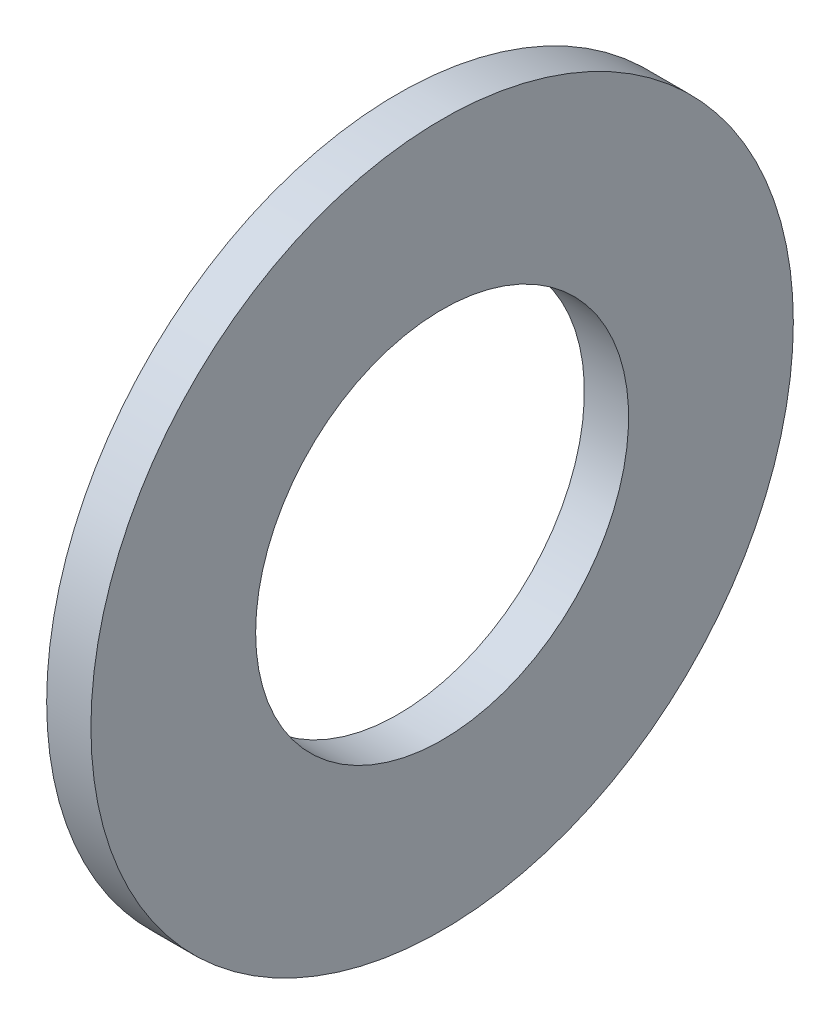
from build123d import *

# Parameters (mm, degrees)
SKETCH1_W = 1.6002
SKETCH1_H = 5.9563


with BuildPart() as part:
    # Sketch1 → Base-Revolve (revolve)
    with BuildSketch(Plane.XY, mode=Mode.PRIVATE) as base_revolve_sk:
        with Locations((-0.8001, 9.72185)):
            Rectangle(SKETCH1_W, SKETCH1_H)
    revolve(base_revolve_sk.sketch.rotate(Axis((-34.925, 0, 0), (1, 0, 0)), 90), axis=Axis((-34.925, 0, 0), (1, 0, 0)))


solid = part.part
